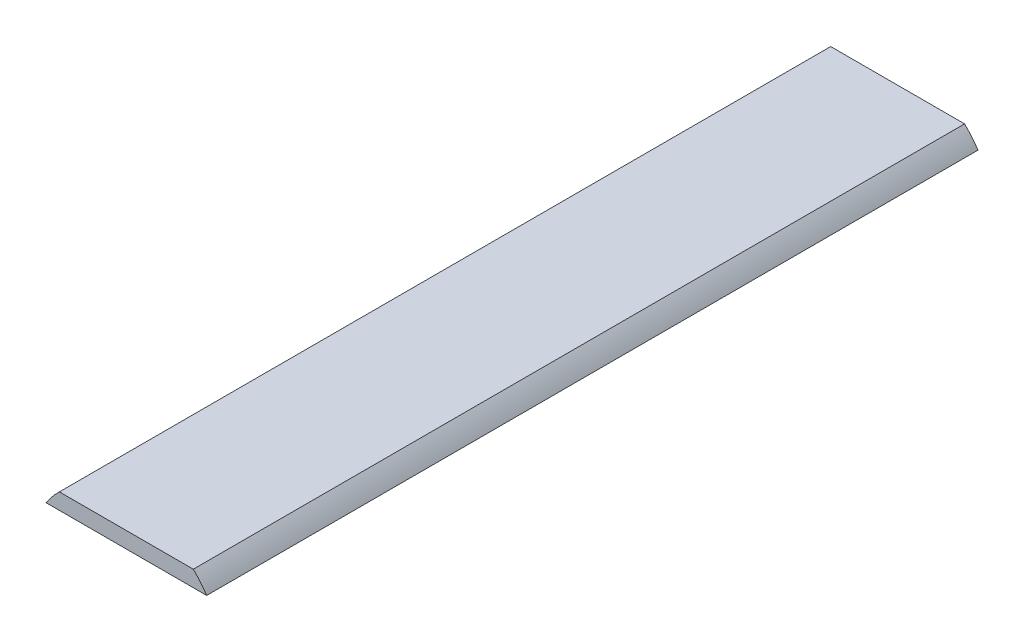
from build123d import *

# Parameters (mm, degrees)
SKETCH1_R          = 19.05
EXTRUDE1_DEPTH     = 152.4
CUT_EXTRUDE1_DEPTH = 155.762931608


with BuildPart() as part:
    # Sketch1 → Extrude1 (new body)
    with BuildSketch(Plane.XY):
        with Locations(Location((0, 0, 0), (0, 0, 180))):
            Circle(SKETCH1_R)
    extrude(amount=EXTRUDE1_DEPTH)

    # Sketch2 → Cut-Extrude1 (cut, through all)
    with BuildSketch(Plane.XY.offset(152.4)):
        with BuildLine():
            Line((-13.231315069, 13.705283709), (13.231315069, 13.705283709))
            ThreePointArc((13.231315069, 13.705283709), (0, 19.05), (-13.231315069, 13.705283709))
        make_face()
        with BuildLine():
            Line((-15.875, 10.530283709), (15.875, 10.530283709))
            ThreePointArc((15.875, 10.530283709), (0, -19.05), (-15.875, 10.530283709))
        make_face()
    extrude(amount=-CUT_EXTRUDE1_DEPTH, mode=Mode.SUBTRACT)


solid = part.part
